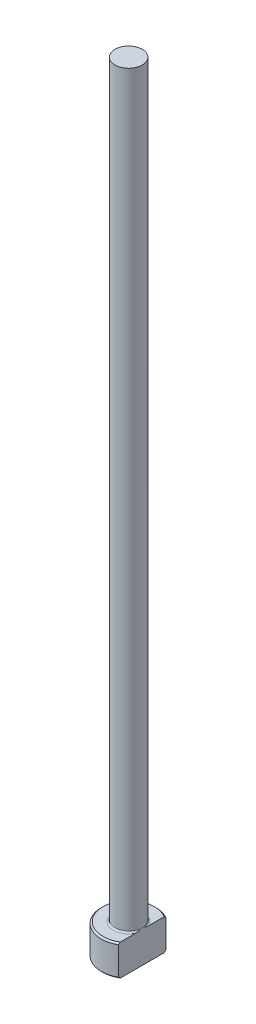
ISO-10303-21;
HEADER;
FILE_DESCRIPTION(('STEP AP214'),'2;1');
FILE_NAME('part.step','',(''),(''),'','','');
FILE_SCHEMA(('AUTOMOTIVE_DESIGN { 1 0 10303 214 1 1 1 1 }'));
ENDSEC;
DATA;
#1=APPLICATION_CONTEXT('core data for automotive mechanical design processes');
#2=APPLICATION_PROTOCOL_DEFINITION('international standard','automotive_design',2000,#1);
#3=PRODUCT_CONTEXT('',#1,'mechanical');
#4=PRODUCT('Part','Part','',(#3));
#5=PRODUCT_RELATED_PRODUCT_CATEGORY('part','',(#4));
#6=PRODUCT_DEFINITION_FORMATION('','',#4);
#7=PRODUCT_DEFINITION_CONTEXT('part definition',#1,'design');
#8=PRODUCT_DEFINITION('design','',#6,#7);
#9=PRODUCT_DEFINITION_SHAPE('','',#8);
#10=(LENGTH_UNIT() NAMED_UNIT(*) SI_UNIT(.MILLI.,.METRE.));
#11=(NAMED_UNIT(*) PLANE_ANGLE_UNIT() SI_UNIT($,.RADIAN.));
#12=(NAMED_UNIT(*) SI_UNIT($,.STERADIAN.) SOLID_ANGLE_UNIT());
#13=UNCERTAINTY_MEASURE_WITH_UNIT(LENGTH_MEASURE(1.E-05),#10,'distance_accuracy_value','');
#14=(GEOMETRIC_REPRESENTATION_CONTEXT(3) GLOBAL_UNCERTAINTY_ASSIGNED_CONTEXT((#13)) GLOBAL_UNIT_ASSIGNED_CONTEXT((#10,
#11,#12)) REPRESENTATION_CONTEXT('',''));
#15=CARTESIAN_POINT('',(0.,0.,0.));
#16=DIRECTION('',(0.,0.,1.));
#17=DIRECTION('',(1.,0.,0.));
#18=AXIS2_PLACEMENT_3D('',#15,#16,#17);
#19=CARTESIAN_POINT('',(0.,0.,0.));
#20=DIRECTION('',(0.,-1.,0.));
#21=DIRECTION('',(0.,0.,-1.));
#22=AXIS2_PLACEMENT_3D('',#19,#20,#21);
#23=PLANE('',#22);
#24=CARTESIAN_POINT('',(0.,0.,0.));
#25=DIRECTION('',(0.,-1.,0.));
#26=DIRECTION('',(0.,0.,-1.));
#27=AXIS2_PLACEMENT_3D('',#24,#25,#26);
#28=CIRCLE('',#27,3.29999999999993);
#29=CARTESIAN_POINT('',(1.74999999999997,0.,2.79776696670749));
#30=VERTEX_POINT('',#29);
#31=CARTESIAN_POINT('',(1.74999999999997,0.,-2.79776696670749));
#32=VERTEX_POINT('',#31);
#33=EDGE_CURVE('E98',#30,#32,#28,.T.);
#34=ORIENTED_EDGE('',*,*,#33,.T.);
#35=DIRECTION('',(0.,0.,1.));
#36=VECTOR('',#35,1.);
#37=CARTESIAN_POINT('',(1.74999999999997,0.,3.03108891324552));
#38=LINE('',#37,#36);
#39=EDGE_CURVE('E83',#32,#30,#38,.T.);
#40=ORIENTED_EDGE('',*,*,#39,.T.);
#41=EDGE_LOOP('',(#34,#40));
#42=FACE_BOUND('',#41,.T.);
#43=ADVANCED_FACE('F32',(#42),#23,.T.);
#44=CARTESIAN_POINT('',(0.,259.958771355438,0.));
#45=DIRECTION('',(0.,1.,0.));
#46=DIRECTION('',(0.,0.,1.));
#47=AXIS2_PLACEMENT_3D('',#44,#45,#46);
#48=CYLINDRICAL_SURFACE('',#47,3.49999999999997);
#49=CARTESIAN_POINT('',(0.,3.80000000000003,0.));
#50=DIRECTION('',(0.,1.,0.));
#51=DIRECTION('',(0.,0.,1.));
#52=AXIS2_PLACEMENT_3D('',#49,#50,#51);
#53=CIRCLE('',#52,3.49999999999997);
#54=CARTESIAN_POINT('',(1.74999999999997,3.80000000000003,3.03108891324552));
#55=VERTEX_POINT('',#54);
#56=CARTESIAN_POINT('',(1.74999999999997,3.80000000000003,-3.03108891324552));
#57=VERTEX_POINT('',#56);
#58=EDGE_CURVE('E104',#55,#57,#53,.F.);
#59=ORIENTED_EDGE('',*,*,#58,.T.);
#60=DIRECTION('',(0.,-1.,0.));
#61=VECTOR('',#60,1.);
#62=CARTESIAN_POINT('',(1.74999999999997,100.,-3.03108891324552));
#63=LINE('',#62,#61);
#64=CARTESIAN_POINT('',(1.74999999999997,0.200000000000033,-3.03108891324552));
#65=VERTEX_POINT('',#64);
#66=EDGE_CURVE('E183',#57,#65,#63,.T.);
#67=ORIENTED_EDGE('',*,*,#66,.T.);
#68=CARTESIAN_POINT('',(0.,0.200000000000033,0.));
#69=DIRECTION('',(0.,-1.,0.));
#70=DIRECTION('',(0.,0.,-1.));
#71=AXIS2_PLACEMENT_3D('',#68,#69,#70);
#72=CIRCLE('',#71,3.49999999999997);
#73=CARTESIAN_POINT('',(1.74999999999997,0.200000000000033,3.03108891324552));
#74=VERTEX_POINT('',#73);
#75=EDGE_CURVE('E100',#65,#74,#72,.F.);
#76=ORIENTED_EDGE('',*,*,#75,.T.);
#77=DIRECTION('',(0.,-1.,0.));
#78=VECTOR('',#77,1.);
#79=CARTESIAN_POINT('',(1.74999999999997,100.,3.03108891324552));
#80=LINE('',#79,#78);
#81=EDGE_CURVE('E93',#55,#74,#80,.T.);
#82=ORIENTED_EDGE('',*,*,#81,.F.);
#83=EDGE_LOOP('',(#59,#67,#76,#82));
#84=FACE_BOUND('',#83,.T.);
#85=ADVANCED_FACE('F158',(#84),#48,.T.);
#86=CARTESIAN_POINT('',(-3.49999999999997,4.,0.));
#87=DIRECTION('',(0.,1.,0.));
#88=DIRECTION('',(0.,0.,1.));
#89=AXIS2_PLACEMENT_3D('',#86,#87,#88);
#90=PLANE('',#89);
#91=CARTESIAN_POINT('',(0.,4.,0.));
#92=DIRECTION('',(0.,1.,0.));
#93=DIRECTION('',(0.,0.,1.));
#94=AXIS2_PLACEMENT_3D('',#91,#92,#93);
#95=CIRCLE('',#94,3.29999999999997);
#96=CARTESIAN_POINT('',(1.74999999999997,4.,-2.79776696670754));
#97=VERTEX_POINT('',#96);
#98=CARTESIAN_POINT('',(1.74999999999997,4.,2.79776696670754));
#99=VERTEX_POINT('',#98);
#100=EDGE_CURVE('E178',#97,#99,#95,.T.);
#101=ORIENTED_EDGE('',*,*,#100,.T.);
#102=DIRECTION('',(0.,0.,-1.));
#103=VECTOR('',#102,1.);
#104=CARTESIAN_POINT('',(1.74999999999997,4.,0.));
#105=LINE('',#104,#103);
#106=CARTESIAN_POINT('',(1.74999999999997,3.99999999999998,0.860232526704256));
#107=VERTEX_POINT('',#106);
#108=EDGE_CURVE('E57',#99,#107,#105,.T.);
#109=ORIENTED_EDGE('',*,*,#108,.T.);
#110=CARTESIAN_POINT('',(0.,4.,0.));
#111=DIRECTION('',(0.,1.,0.));
#112=DIRECTION('',(0.,0.,1.));
#113=AXIS2_PLACEMENT_3D('',#110,#111,#112);
#114=CIRCLE('',#113,1.94999999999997);
#115=CARTESIAN_POINT('',(1.74999999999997,3.99999999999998,-0.860232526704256));
#116=VERTEX_POINT('',#115);
#117=EDGE_CURVE('E107',#107,#116,#114,.F.);
#118=ORIENTED_EDGE('',*,*,#117,.T.);
#119=EDGE_CURVE('E136',#116,#97,#105,.T.);
#120=ORIENTED_EDGE('',*,*,#119,.T.);
#121=EDGE_LOOP('',(#101,#109,#118,#120));
#122=FACE_BOUND('',#121,.T.);
#123=ADVANCED_FACE('F147',(#122),#90,.T.);
#124=CARTESIAN_POINT('',(0.,4.,0.));
#125=DIRECTION('',(0.,-1.,0.));
#126=DIRECTION('',(0.,0.,-1.));
#127=AXIS2_PLACEMENT_3D('',#124,#125,#126);
#128=CONICAL_SURFACE('',#127,3.29999999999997,0.785398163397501);
#129=ORIENTED_EDGE('',*,*,#58,.F.);
#130=CARTESIAN_POINT('',(1.74999999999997,0.403691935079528,6.67057455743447));
#131=CARTESIAN_POINT('',(1.74999999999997,0.549902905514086,6.51940719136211));
#132=CARTESIAN_POINT('',(1.74999999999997,0.695956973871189,6.3680875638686));
#133=CARTESIAN_POINT('',(1.74999999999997,0.987658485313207,6.06505321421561));
#134=CARTESIAN_POINT('',(1.74999999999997,1.13330592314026,5.91333848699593));
#135=CARTESIAN_POINT('',(1.74999999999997,1.42417201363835,5.60934946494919));
#136=CARTESIAN_POINT('',(1.74999999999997,1.56939040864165,5.45707492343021));
#137=CARTESIAN_POINT('',(1.74999999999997,1.85918520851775,5.15191761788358));
#138=CARTESIAN_POINT('',(1.74999999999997,2.0037616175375,4.9990348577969));
#139=CARTESIAN_POINT('',(1.74999999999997,2.28922437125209,4.69552747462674));
#140=CARTESIAN_POINT('',(1.74999999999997,2.43012702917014,4.54491820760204));
#141=CARTESIAN_POINT('',(1.74999999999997,2.71087777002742,4.24272028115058));
#142=CARTESIAN_POINT('',(1.74999999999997,2.85072585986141,4.0911316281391));
#143=CARTESIAN_POINT('',(1.74999999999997,3.12895853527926,3.78667524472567));
#144=CARTESIAN_POINT('',(1.74999999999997,3.26734342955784,3.63380779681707));
#145=CARTESIAN_POINT('',(1.74999999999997,3.54209958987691,3.32627683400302));
#146=CARTESIAN_POINT('',(1.74999999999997,3.67847093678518,3.17161339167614));
#147=CARTESIAN_POINT('',(1.74999999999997,3.8961728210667,2.91990258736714));
#148=CARTESIAN_POINT('',(1.74999999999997,3.97843114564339,2.82365864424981));
#149=CARTESIAN_POINT('',(1.74999999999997,4.14148360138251,2.62991861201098));
#150=CARTESIAN_POINT('',(1.74999999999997,4.2222775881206,2.53242240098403));
#151=CARTESIAN_POINT('',(1.74999999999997,4.38274452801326,2.33479038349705));
#152=CARTESIAN_POINT('',(1.74999999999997,4.46239661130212,2.23463757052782));
#153=CARTESIAN_POINT('',(1.74999999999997,4.61891495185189,2.03220225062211));
#154=CARTESIAN_POINT('',(1.74999999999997,4.69578187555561,1.92992026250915));
#155=CARTESIAN_POINT('',(1.74999999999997,4.84669654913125,1.72090511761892));
#156=CARTESIAN_POINT('',(1.74999999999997,4.92068375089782,1.61412795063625));
#157=CARTESIAN_POINT('',(1.74999999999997,5.06269616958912,1.39638381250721));
#158=CARTESIAN_POINT('',(1.74999999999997,5.13071318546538,1.28541136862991));
#159=CARTESIAN_POINT('',(1.74999999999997,5.22516490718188,1.11561175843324));
#160=CARTESIAN_POINT('',(1.74999999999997,5.25522351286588,1.058816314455));
#161=CARTESIAN_POINT('',(1.74999999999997,5.31237042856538,0.943756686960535));
#162=CARTESIAN_POINT('',(1.74999999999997,5.33945819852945,0.885492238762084));
#163=CARTESIAN_POINT('',(1.74999999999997,5.41499290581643,0.708569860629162));
#164=CARTESIAN_POINT('',(1.74999999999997,5.45796078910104,0.58735672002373));
#165=CARTESIAN_POINT('',(1.74999999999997,5.50447230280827,0.405622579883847));
#166=CARTESIAN_POINT('',(1.74999999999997,5.51680920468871,0.347327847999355));
#167=CARTESIAN_POINT('',(1.74999999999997,5.53592536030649,0.229813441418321));
#168=CARTESIAN_POINT('',(1.74999999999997,5.54270510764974,0.170593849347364));
#169=CARTESIAN_POINT('',(1.74999999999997,5.55022681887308,0.0519516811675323));
#170=CARTESIAN_POINT('',(1.74999999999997,5.55098747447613,-0.00746969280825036));
#171=CARTESIAN_POINT('',(1.74999999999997,5.5464654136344,-0.12608281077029));
#172=CARTESIAN_POINT('',(1.74999999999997,5.54118219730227,-0.185274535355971));
#173=CARTESIAN_POINT('',(1.74999999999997,5.52501178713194,-0.302357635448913));
#174=CARTESIAN_POINT('',(1.74999999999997,5.51417270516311,-0.360255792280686));
#175=CARTESIAN_POINT('',(1.74999999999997,5.48756668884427,-0.474896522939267));
#176=CARTESIAN_POINT('',(1.74999999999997,5.47179916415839,-0.531638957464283));
#177=CARTESIAN_POINT('',(1.74999999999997,5.43599695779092,-0.64410319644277));
#178=CARTESIAN_POINT('',(1.74999999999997,5.41593824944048,-0.699817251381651));
#179=CARTESIAN_POINT('',(1.74999999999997,5.37235913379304,-0.809843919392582));
#180=CARTESIAN_POINT('',(1.74999999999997,5.348839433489,-0.864156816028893));
#181=CARTESIAN_POINT('',(1.74999999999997,5.27385837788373,-1.0256237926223));
#182=CARTESIAN_POINT('',(1.74999999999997,5.21814894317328,-1.13079943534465));
#183=CARTESIAN_POINT('',(1.74999999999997,5.09935726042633,-1.33694307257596));
#184=CARTESIAN_POINT('',(1.74999999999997,5.03626572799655,-1.43790554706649));
#185=CARTESIAN_POINT('',(1.74999999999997,4.90490246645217,-1.63694628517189));
#186=CARTESIAN_POINT('',(1.74999999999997,4.83661129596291,-1.73501160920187));
#187=CARTESIAN_POINT('',(1.74999999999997,4.69663576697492,-1.92859117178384));
#188=CARTESIAN_POINT('',(1.74999999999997,4.62495312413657,-2.02410666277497));
#189=CARTESIAN_POINT('',(1.74999999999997,4.47817312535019,-2.21448054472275));
#190=CARTESIAN_POINT('',(1.74999999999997,4.4030432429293,-2.30931373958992));
#191=CARTESIAN_POINT('',(1.74999999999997,4.25092223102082,-2.49748629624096));
#192=CARTESIAN_POINT('',(1.74999999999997,4.17393090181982,-2.59082549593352));
#193=CARTESIAN_POINT('',(1.74999999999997,4.01873588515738,-2.77610276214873));
#194=CARTESIAN_POINT('',(1.74999999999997,3.94053559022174,-2.86804367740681));
#195=CARTESIAN_POINT('',(1.74999999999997,3.78305359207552,-3.05099558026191));
#196=CARTESIAN_POINT('',(1.74999999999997,3.70377186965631,-3.14200655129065));
#197=CARTESIAN_POINT('',(1.74999999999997,3.4917775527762,-3.38307713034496));
#198=CARTESIAN_POINT('',(1.74999999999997,3.3583209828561,-3.53248201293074));
#199=CARTESIAN_POINT('',(1.74999999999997,3.08977689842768,-3.82982116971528));
#200=CARTESIAN_POINT('',(1.74999999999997,2.95468933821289,-3.97775540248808));
#201=CARTESIAN_POINT('',(1.74999999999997,2.68319766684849,-4.27266697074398));
#202=CARTESIAN_POINT('',(1.74999999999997,2.5467924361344,-4.41964327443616));
#203=CARTESIAN_POINT('',(1.74999999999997,2.27308598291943,-4.71275937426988));
#204=CARTESIAN_POINT('',(1.74999999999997,2.13578475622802,-4.85889916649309));
#205=CARTESIAN_POINT('',(1.74999999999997,1.73418398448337,-5.28435414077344));
#206=CARTESIAN_POINT('',(1.74999999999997,1.46897142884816,-5.56280727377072));
#207=CARTESIAN_POINT('',(1.74999999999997,1.07010496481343,-5.97918348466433));
#208=CARTESIAN_POINT('',(1.74999999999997,0.937049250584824,-6.11768155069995));
#209=CARTESIAN_POINT('',(1.74999999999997,0.670604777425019,-6.39435480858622));
#210=CARTESIAN_POINT('',(1.74999999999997,0.537216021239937,-6.53253000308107));
#211=CARTESIAN_POINT('',(1.74999999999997,0.403691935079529,-6.67057455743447));
#212=B_SPLINE_CURVE_WITH_KNOTS('',3,(#130,#131,#132,#133,#134,#135,#136,#137,#138,#139,#140,
#141,#142,#143,#144,#145,#146,#147,#148,#149,#150,#151,#152,#153,#154,#155,#156,#157,#158,#159,
#160,#161,#162,#163,#164,#165,#166,#167,#168,#169,#170,#171,#172,#173,#174,#175,#176,#177,#178,
#179,#180,#181,#182,#183,#184,#185,#186,#187,#188,#189,#190,#191,#192,#193,#194,#195,#196,#197,
#198,#199,#200,#201,#202,#203,#204,#205,#206,#207,#208,#209,#210,#211),.UNSPECIFIED.,.F.,.F.,(4,
2,2,2,2,2,2,2,2,2,2,2,2,2,2,2,2,2,2,2,2,2,2,2,2,2,2,2,2,2,2,2,2,2,2,2,2,2,2,2,4),(0.,
0.630922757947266,1.26185363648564,1.89310749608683,2.52435727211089,3.14308654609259,
3.76181177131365,4.38040374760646,4.9989708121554,5.37878108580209,5.7586286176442,
6.14249031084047,6.52625953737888,6.91585739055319,7.30598230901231,7.49867618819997,
7.69140503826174,8.07538783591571,8.25392686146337,8.43245002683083,8.61041858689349,
8.78840186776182,8.96486927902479,9.14135783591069,9.31886171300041,9.49632938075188,
9.85286274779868,10.2098494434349,10.5682434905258,10.9264581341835,11.2893876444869,
11.6523562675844,12.0144447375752,12.3765396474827,12.9775131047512,13.5785034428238,
14.1800594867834,14.7816183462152,15.9352370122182,16.51140505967,17.0875683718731),.UNSPECIFIED.);
#213=EDGE_CURVE('E135',#55,#99,#212,.T.);
#214=ORIENTED_EDGE('',*,*,#213,.T.);
#215=ORIENTED_EDGE('',*,*,#100,.F.);
#216=EDGE_CURVE('E127',#97,#57,#212,.T.);
#217=ORIENTED_EDGE('',*,*,#216,.T.);
#218=EDGE_LOOP('',(#129,#214,#215,#217));
#219=FACE_BOUND('',#218,.T.);
#220=ADVANCED_FACE('F143',(#219),#128,.T.);
#221=CARTESIAN_POINT('',(0.,0.200000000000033,0.));
#222=DIRECTION('',(0.,1.,0.));
#223=DIRECTION('',(0.,0.,1.));
#224=AXIS2_PLACEMENT_3D('',#221,#222,#223);
#225=CONICAL_SURFACE('',#224,3.49999999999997,0.785398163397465);
#226=ORIENTED_EDGE('',*,*,#75,.F.);
#227=CARTESIAN_POINT('',(1.74999999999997,3.59630806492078,-6.67057455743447));
#228=CARTESIAN_POINT('',(1.74999999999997,3.4500970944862,-6.51940719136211));
#229=CARTESIAN_POINT('',(1.74999999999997,3.30404302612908,-6.36808756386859));
#230=CARTESIAN_POINT('',(1.74999999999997,3.01234151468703,-6.06505321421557));
#231=CARTESIAN_POINT('',(1.74999999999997,2.86669407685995,-5.91333848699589));
#232=CARTESIAN_POINT('',(1.74999999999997,2.57582798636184,-5.60934946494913));
#233=CARTESIAN_POINT('',(1.74999999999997,2.43060959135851,-5.45707492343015));
#234=CARTESIAN_POINT('',(1.74999999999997,2.14081479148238,-5.15191761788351));
#235=CARTESIAN_POINT('',(1.74999999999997,1.99623838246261,-4.99903485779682));
#236=CARTESIAN_POINT('',(1.74999999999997,1.71077562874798,-4.69552747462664));
#237=CARTESIAN_POINT('',(1.74999999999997,1.56987297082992,-4.54491820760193));
#238=CARTESIAN_POINT('',(1.74999999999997,1.28912222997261,-4.24272028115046));
#239=CARTESIAN_POINT('',(1.74999999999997,1.1492741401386,-4.09113162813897));
#240=CARTESIAN_POINT('',(1.74999999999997,0.87104146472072,-3.78667524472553));
#241=CARTESIAN_POINT('',(1.74999999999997,0.73265657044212,-3.63380779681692));
#242=CARTESIAN_POINT('',(1.74999999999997,0.457900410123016,-3.32627683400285));
#243=CARTESIAN_POINT('',(1.74999999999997,0.321529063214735,-3.17161339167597));
#244=CARTESIAN_POINT('',(1.74999999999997,0.103827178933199,-2.91990258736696));
#245=CARTESIAN_POINT('',(1.74999999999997,0.0215688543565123,-2.82365864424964));
#246=CARTESIAN_POINT('',(1.74999999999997,-0.14148360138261,-2.62991861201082));
#247=CARTESIAN_POINT('',(1.74999999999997,-0.222277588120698,-2.53242240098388));
#248=CARTESIAN_POINT('',(1.74999999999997,-0.382744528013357,-2.3347903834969));
#249=CARTESIAN_POINT('',(1.74999999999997,-0.462396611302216,-2.23463757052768));
#250=CARTESIAN_POINT('',(1.74999999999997,-0.618914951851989,-2.03220225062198));
#251=CARTESIAN_POINT('',(1.74999999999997,-0.695781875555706,-1.92992026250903));
#252=CARTESIAN_POINT('',(1.74999999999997,-0.84669654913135,-1.7209051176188));
#253=CARTESIAN_POINT('',(1.74999999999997,-0.920683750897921,-1.61412795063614));
#254=CARTESIAN_POINT('',(1.74999999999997,-1.06269616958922,-1.3963838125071));
#255=CARTESIAN_POINT('',(1.74999999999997,-1.13071318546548,-1.28541136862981));
#256=CARTESIAN_POINT('',(1.74999999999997,-1.22516490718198,-1.11561175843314));
#257=CARTESIAN_POINT('',(1.74999999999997,-1.25522351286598,-1.05881631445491));
#258=CARTESIAN_POINT('',(1.74999999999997,-1.31237042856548,-0.943756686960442));
#259=CARTESIAN_POINT('',(1.74999999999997,-1.33945819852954,-0.885492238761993));
#260=CARTESIAN_POINT('',(1.74999999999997,-1.41499290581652,-0.708569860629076));
#261=CARTESIAN_POINT('',(1.74999999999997,-1.45796078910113,-0.587356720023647));
#262=CARTESIAN_POINT('',(1.74999999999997,-1.50447230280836,-0.405622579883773));
#263=CARTESIAN_POINT('',(1.74999999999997,-1.51680920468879,-0.347327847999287));
#264=CARTESIAN_POINT('',(1.74999999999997,-1.53592536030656,-0.229813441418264));
#265=CARTESIAN_POINT('',(1.74999999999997,-1.54270510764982,-0.170593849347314));
#266=CARTESIAN_POINT('',(1.74999999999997,-1.55022681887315,-0.0519516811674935));
#267=CARTESIAN_POINT('',(1.74999999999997,-1.5509874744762,0.00746969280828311));
#268=CARTESIAN_POINT('',(1.74999999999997,-1.54646541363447,0.126082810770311));
#269=CARTESIAN_POINT('',(1.74999999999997,-1.54118219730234,0.185274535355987));
#270=CARTESIAN_POINT('',(1.74999999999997,-1.52501178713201,0.302357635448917));
#271=CARTESIAN_POINT('',(1.74999999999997,-1.51417270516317,0.360255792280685));
#272=CARTESIAN_POINT('',(1.74999999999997,-1.48756668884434,0.474896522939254));
#273=CARTESIAN_POINT('',(1.74999999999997,-1.47179916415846,0.531638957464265));
#274=CARTESIAN_POINT('',(1.74999999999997,-1.43599695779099,0.64410319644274));
#275=CARTESIAN_POINT('',(1.74999999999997,-1.41593824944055,0.699817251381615));
#276=CARTESIAN_POINT('',(1.74999999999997,-1.37235913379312,0.809843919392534));
#277=CARTESIAN_POINT('',(1.74999999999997,-1.34883943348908,0.86415681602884));
#278=CARTESIAN_POINT('',(1.74999999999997,-1.27385837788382,1.02562379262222));
#279=CARTESIAN_POINT('',(1.74999999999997,-1.21814894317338,1.13079943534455));
#280=CARTESIAN_POINT('',(1.74999999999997,-1.09935726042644,1.33694307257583));
#281=CARTESIAN_POINT('',(1.74999999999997,-1.03626572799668,1.43790554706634));
#282=CARTESIAN_POINT('',(1.74999999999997,-0.904902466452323,1.6369462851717));
#283=CARTESIAN_POINT('',(1.74999999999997,-0.836611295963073,1.73501160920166));
#284=CARTESIAN_POINT('',(1.74999999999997,-0.696635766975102,1.9285911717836));
#285=CARTESIAN_POINT('',(1.74999999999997,-0.624953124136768,2.02410666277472));
#286=CARTESIAN_POINT('',(1.74999999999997,-0.478173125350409,2.21448054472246));
#287=CARTESIAN_POINT('',(1.74999999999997,-0.40304324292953,2.30931373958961));
#288=CARTESIAN_POINT('',(1.74999999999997,-0.250922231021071,2.49748629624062));
#289=CARTESIAN_POINT('',(1.74999999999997,-0.173930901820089,2.59082549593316));
#290=CARTESIAN_POINT('',(1.74999999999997,-0.0187358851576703,2.77610276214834));
#291=CARTESIAN_POINT('',(1.74999999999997,0.0594644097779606,2.8680436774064));
#292=CARTESIAN_POINT('',(1.74999999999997,0.216946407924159,3.05099558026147));
#293=CARTESIAN_POINT('',(1.74999999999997,0.296228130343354,3.14200655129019));
#294=CARTESIAN_POINT('',(1.74999999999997,0.508222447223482,3.3830771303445));
#295=CARTESIAN_POINT('',(1.74999999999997,0.641679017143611,3.53248201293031));
#296=CARTESIAN_POINT('',(1.74999999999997,0.910223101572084,3.8298211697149));
#297=CARTESIAN_POINT('',(1.74999999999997,1.0453106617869,3.97775540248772));
#298=CARTESIAN_POINT('',(1.74999999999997,1.31680233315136,4.27266697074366));
#299=CARTESIAN_POINT('',(1.74999999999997,1.45320756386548,4.41964327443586));
#300=CARTESIAN_POINT('',(1.74999999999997,1.7269140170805,4.71275937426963));
#301=CARTESIAN_POINT('',(1.74999999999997,1.86421524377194,4.85889916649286));
#302=CARTESIAN_POINT('',(1.74999999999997,2.26581601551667,5.28435414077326));
#303=CARTESIAN_POINT('',(1.74999999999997,2.53102857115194,5.56280727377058));
#304=CARTESIAN_POINT('',(1.74999999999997,2.92989503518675,5.97918348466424));
#305=CARTESIAN_POINT('',(1.74999999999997,3.06295074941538,6.11768155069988));
#306=CARTESIAN_POINT('',(1.74999999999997,3.32939522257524,6.39435480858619));
#307=CARTESIAN_POINT('',(1.74999999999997,3.46278397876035,6.53253000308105));
#308=CARTESIAN_POINT('',(1.74999999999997,3.59630806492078,6.67057455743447));
#309=B_SPLINE_CURVE_WITH_KNOTS('',3,(#227,#228,#229,#230,#231,#232,#233,#234,#235,#236,#237,
#238,#239,#240,#241,#242,#243,#244,#245,#246,#247,#248,#249,#250,#251,#252,#253,#254,#255,#256,
#257,#258,#259,#260,#261,#262,#263,#264,#265,#266,#267,#268,#269,#270,#271,#272,#273,#274,#275,
#276,#277,#278,#279,#280,#281,#282,#283,#284,#285,#286,#287,#288,#289,#290,#291,#292,#293,#294,
#295,#296,#297,#298,#299,#300,#301,#302,#303,#304,#305,#306,#307,#308),.UNSPECIFIED.,.F.,.F.,(4,
2,2,2,2,2,2,2,2,2,2,2,2,2,2,2,2,2,2,2,2,2,2,2,2,2,2,2,2,2,2,2,2,2,2,2,2,2,2,2,4),(0.,
0.630922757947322,1.26185363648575,1.893107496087,2.5243572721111,3.14308654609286,
3.76181177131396,4.38040374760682,4.99897081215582,5.37878108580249,5.75862861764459,
6.14249031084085,6.52625953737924,6.91585739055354,7.30598230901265,7.49867618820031,
7.69140503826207,8.07538783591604,8.25392686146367,8.43245002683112,8.61041858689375,
8.78840186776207,8.96486927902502,9.14135783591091,9.31886171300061,9.49632938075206,
9.8528627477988,10.209849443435,10.5682434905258,10.9264581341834,11.2893876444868,
11.6523562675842,12.014444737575,12.3765396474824,12.977513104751,13.5785034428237,
14.1800594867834,14.7816183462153,15.9352370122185,16.5114050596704,17.0875683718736),.UNSPECIFIED.);
#310=EDGE_CURVE('E86',#65,#32,#309,.T.);
#311=ORIENTED_EDGE('',*,*,#310,.T.);
#312=ORIENTED_EDGE('',*,*,#33,.F.);
#313=EDGE_CURVE('E89',#30,#74,#309,.T.);
#314=ORIENTED_EDGE('',*,*,#313,.T.);
#315=EDGE_LOOP('',(#226,#311,#312,#314));
#316=FACE_BOUND('',#315,.T.);
#317=ADVANCED_FACE('F97',(#316),#225,.T.);
#318=CARTESIAN_POINT('',(0.,4.19999999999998,0.));
#319=DIRECTION('',(0.,1.,0.));
#320=DIRECTION('',(0.,0.,1.));
#321=AXIS2_PLACEMENT_3D('',#318,#319,#320);
#322=TOROIDAL_SURFACE('',#321,1.94999999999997,0.2);
#323=CARTESIAN_POINT('',(1.74999999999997,4.19999999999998,0.));
#324=CARTESIAN_POINT('',(1.74999999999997,4.2000005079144,9.3867964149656E-11));
#325=CARTESIAN_POINT('',(1.74999999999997,4.20000101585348,-1.34501103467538E-07));
#326=CARTESIAN_POINT('',(1.74999999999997,4.20000198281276,-5.41283480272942E-07));
#327=CARTESIAN_POINT('',(1.74999999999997,4.20000243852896,-8.19487716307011E-07));
#328=CARTESIAN_POINT('',(1.74999999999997,4.2000033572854,-1.4843911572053E-06));
#329=CARTESIAN_POINT('',(1.74999999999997,4.20000381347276,-1.8805263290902E-06));
#330=CARTESIAN_POINT('',(1.74999999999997,4.2000046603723,-2.72280867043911E-06));
#331=CARTESIAN_POINT('',(1.74999999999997,4.20000505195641,-3.16812554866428E-06));
#332=CARTESIAN_POINT('',(1.74999999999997,4.20000641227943,-4.80772283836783E-06));
#333=CARTESIAN_POINT('',(1.74999999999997,4.20000730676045,-6.06508173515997E-06));
#334=CARTESIAN_POINT('',(1.74999999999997,4.20000885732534,-8.62364313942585E-06));
#335=CARTESIAN_POINT('',(1.74999999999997,4.2000095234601,-9.91907771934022E-06));
#336=CARTESIAN_POINT('',(1.74999999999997,4.20001212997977,-1.51310766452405E-05));
#337=CARTESIAN_POINT('',(1.74999999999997,4.20001395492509,-1.91092656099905E-05));
#338=CARTESIAN_POINT('',(1.74999999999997,4.200016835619,-2.68327807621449E-05));
#339=CARTESIAN_POINT('',(1.74999999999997,4.20001795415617,-3.05551301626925E-05));
#340=CARTESIAN_POINT('',(1.74999999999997,4.20002287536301,-4.68261375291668E-05));
#341=CARTESIAN_POINT('',(1.74999999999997,4.20002674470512,-5.93446279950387E-05));
#342=CARTESIAN_POINT('',(1.74999999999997,4.20003278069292,-8.25255943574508E-05));
#343=CARTESIAN_POINT('',(1.74999999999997,4.2000351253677,-9.31393224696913E-05));
#344=CARTESIAN_POINT('',(1.74999999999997,4.20005413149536,-0.000171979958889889));
#345=CARTESIAN_POINT('',(1.74999999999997,4.20007897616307,-0.000237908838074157));
#346=CARTESIAN_POINT('',(1.74999999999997,4.20017305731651,-0.000496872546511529));
#347=CARTESIAN_POINT('',(1.74999999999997,4.20023617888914,-0.000691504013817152));
#348=CARTESIAN_POINT('',(1.74999999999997,4.20048774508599,-0.00145613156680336));
#349=CARTESIAN_POINT('',(1.74999999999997,4.20068259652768,-0.00202450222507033));
#350=CARTESIAN_POINT('',(1.74999999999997,4.20148279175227,-0.00436941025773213));
#351=CARTESIAN_POINT('',(1.74999999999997,4.20208089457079,-0.00614773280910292));
#352=CARTESIAN_POINT('',(1.74999999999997,4.20853845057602,-0.0253339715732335));
#353=CARTESIAN_POINT('',(1.74999999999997,4.21443574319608,-0.0427328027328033));
#354=CARTESIAN_POINT('',(1.74999999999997,4.22594434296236,-0.076884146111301));
#355=CARTESIAN_POINT('',(1.74999999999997,4.23155796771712,-0.0936359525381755));
#356=CARTESIAN_POINT('',(1.74999999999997,4.24339960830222,-0.129193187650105));
#357=CARTESIAN_POINT('',(1.74999999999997,4.24961959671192,-0.148001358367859));
#358=CARTESIAN_POINT('',(1.74999999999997,4.26199268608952,-0.185858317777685));
#359=CARTESIAN_POINT('',(1.74999999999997,4.26814439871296,-0.204907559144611));
#360=CARTESIAN_POINT('',(1.74999999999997,4.28302129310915,-0.251728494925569));
#361=CARTESIAN_POINT('',(1.74999999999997,4.2916463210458,-0.279532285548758));
#362=CARTESIAN_POINT('',(1.74999999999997,4.30815507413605,-0.334622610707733));
#363=CARTESIAN_POINT('',(1.74999999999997,4.3160517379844,-0.36190524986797));
#364=CARTESIAN_POINT('',(1.74999999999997,4.33270110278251,-0.422187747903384));
#365=CARTESIAN_POINT('',(1.74999999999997,4.34130455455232,-0.455229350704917));
#366=CARTESIAN_POINT('',(1.74999999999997,4.35728256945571,-0.521873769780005));
#367=CARTESIAN_POINT('',(1.74999999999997,4.36464748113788,-0.555478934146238));
#368=CARTESIAN_POINT('',(1.74999999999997,4.37810121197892,-0.625225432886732));
#369=CARTESIAN_POINT('',(1.74999999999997,4.38407559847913,-0.661389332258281));
#370=CARTESIAN_POINT('',(1.74999999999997,4.39348021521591,-0.733973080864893));
#371=CARTESIAN_POINT('',(1.74999999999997,4.39691695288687,-0.77039203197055));
#372=CARTESIAN_POINT('',(1.74999999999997,4.39990626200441,-0.832262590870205));
#373=CARTESIAN_POINT('',(1.74999999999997,4.40032395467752,-0.857670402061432));
#374=CARTESIAN_POINT('',(1.74999999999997,4.39916217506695,-0.908260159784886));
#375=CARTESIAN_POINT('',(1.74999999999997,4.39759783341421,-0.933442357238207));
#376=CARTESIAN_POINT('',(1.74999999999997,4.39129859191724,-0.989903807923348));
#377=CARTESIAN_POINT('',(1.74999999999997,4.38586007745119,-1.02110925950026));
#378=CARTESIAN_POINT('',(1.74999999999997,4.36964168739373,-1.08216800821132));
#379=CARTESIAN_POINT('',(1.74999999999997,4.35888918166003,-1.11202738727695));
#380=CARTESIAN_POINT('',(1.74999999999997,4.33961802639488,-1.14878048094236));
#381=CARTESIAN_POINT('',(1.74999999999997,4.33455492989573,-1.15748014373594));
#382=CARTESIAN_POINT('',(1.74999999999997,4.32351587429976,-1.17429661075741));
#383=CARTESIAN_POINT('',(1.74999999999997,4.31753946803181,-1.18241312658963));
#384=CARTESIAN_POINT('',(1.74999999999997,4.30451428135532,-1.19787793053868));
#385=CARTESIAN_POINT('',(1.74999999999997,4.29745609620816,-1.20521842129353));
#386=CARTESIAN_POINT('',(1.74999999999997,4.28223524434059,-1.21865698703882));
#387=CARTESIAN_POINT('',(1.74999999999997,4.27407476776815,-1.22475746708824));
#388=CARTESIAN_POINT('',(1.74999999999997,4.25920166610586,-1.23370537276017));
#389=CARTESIAN_POINT('',(1.74999999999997,4.25274944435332,-1.23698363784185));
#390=CARTESIAN_POINT('',(1.74999999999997,4.23939659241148,-1.24245066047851));
#391=CARTESIAN_POINT('',(1.74999999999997,4.23249637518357,-1.2446404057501));
#392=CARTESIAN_POINT('',(1.74999999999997,4.21836445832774,-1.24776583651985));
#393=CARTESIAN_POINT('',(1.74999999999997,4.21113087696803,-1.24869317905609));
#394=CARTESIAN_POINT('',(1.74999999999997,4.19661788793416,-1.24917680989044));
#395=CARTESIAN_POINT('',(1.74999999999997,4.18933848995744,-1.2487333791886));
#396=CARTESIAN_POINT('',(1.74999999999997,4.17564813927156,-1.2466228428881));
#397=CARTESIAN_POINT('',(1.74999999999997,4.16921873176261,-1.24507159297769));
#398=CARTESIAN_POINT('',(1.74999999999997,4.1566813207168,-1.24099086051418));
#399=CARTESIAN_POINT('',(1.74999999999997,4.15057343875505,-1.23846101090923));
#400=CARTESIAN_POINT('',(1.74999999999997,4.13656990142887,-1.23147130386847));
#401=CARTESIAN_POINT('',(1.74999999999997,4.12885825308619,-1.22664351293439));
#402=CARTESIAN_POINT('',(1.74999999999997,4.11430996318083,-1.21581214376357));
#403=CARTESIAN_POINT('',(1.74999999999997,4.10747539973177,-1.20980585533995));
#404=CARTESIAN_POINT('',(1.74999999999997,4.09141283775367,-1.19367262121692));
#405=CARTESIAN_POINT('',(1.74999999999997,4.08273353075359,-1.18300273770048));
#406=CARTESIAN_POINT('',(1.74999999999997,4.06710756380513,-1.16049397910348));
#407=CARTESIAN_POINT('',(1.74999999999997,4.06016260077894,-1.14865397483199));
#408=CARTESIAN_POINT('',(1.74999999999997,4.04314403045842,-1.11526045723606));
#409=CARTESIAN_POINT('',(1.74999999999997,4.03452872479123,-1.09297031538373));
#410=CARTESIAN_POINT('',(1.74999999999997,4.02051872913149,-1.04724849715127));
#411=CARTESIAN_POINT('',(1.74999999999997,4.015155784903,-1.02380790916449));
#412=CARTESIAN_POINT('',(1.74999999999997,4.00698483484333,-0.976403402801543));
#413=CARTESIAN_POINT('',(1.74999999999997,4.00418732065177,-0.952437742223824));
#414=CARTESIAN_POINT('',(1.74999999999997,4.00064912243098,-0.904321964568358));
#415=CARTESIAN_POINT('',(1.74999999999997,3.99991269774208,-0.88017156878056));
#416=CARTESIAN_POINT('',(1.74999999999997,4.00019275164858,-0.809643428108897));
#417=CARTESIAN_POINT('',(1.74999999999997,4.00344813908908,-0.763278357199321));
#418=CARTESIAN_POINT('',(1.74999999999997,4.01492484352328,-0.664825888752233));
#419=CARTESIAN_POINT('',(1.74999999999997,4.02376250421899,-0.612819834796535));
#420=CARTESIAN_POINT('',(1.74999999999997,4.04538488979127,-0.508370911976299));
#421=CARTESIAN_POINT('',(1.74999999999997,4.0582587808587,-0.455947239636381));
#422=CARTESIAN_POINT('',(1.74999999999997,4.08196429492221,-0.368604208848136));
#423=CARTESIAN_POINT('',(1.74999999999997,4.09211504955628,-0.333493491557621));
#424=CARTESIAN_POINT('',(1.74999999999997,4.11312724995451,-0.263893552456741));
#425=CARTESIAN_POINT('',(1.74999999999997,4.12397997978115,-0.229401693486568));
#426=CARTESIAN_POINT('',(1.74999999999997,4.14496676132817,-0.164340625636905));
#427=CARTESIAN_POINT('',(1.74999999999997,4.15504975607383,-0.133754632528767));
#428=CARTESIAN_POINT('',(1.74999999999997,4.17587821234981,-0.0714242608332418));
#429=CARTESIAN_POINT('',(1.74999999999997,4.18663395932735,-0.0396831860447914));
#430=CARTESIAN_POINT('',(1.74999999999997,4.19791979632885,-0.00614534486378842));
#431=CARTESIAN_POINT('',(1.74999999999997,4.19851877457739,-0.00436467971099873));
#432=CARTESIAN_POINT('',(1.74999999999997,4.19931918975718,-0.00201922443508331));
#433=CARTESIAN_POINT('',(1.74999999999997,4.19951342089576,-0.00145265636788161));
#434=CARTESIAN_POINT('',(1.74999999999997,4.19976423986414,-0.000690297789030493));
#435=CARTESIAN_POINT('',(1.74999999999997,4.19982721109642,-0.000496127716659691));
#436=CARTESIAN_POINT('',(1.74999999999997,4.19992109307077,-0.000237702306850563));
#437=CARTESIAN_POINT('',(1.74999999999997,4.19994590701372,-0.000171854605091));
#438=CARTESIAN_POINT('',(1.74999999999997,4.19996489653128,-9.3104554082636E-05));
#439=CARTESIAN_POINT('',(1.74999999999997,4.1999672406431,-8.24963339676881E-05));
#440=CARTESIAN_POINT('',(1.74999999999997,4.19997327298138,-5.9327776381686E-05));
#441=CARTESIAN_POINT('',(1.74999999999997,4.19997713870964,-4.68160430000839E-05));
#442=CARTESIAN_POINT('',(1.74999999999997,4.19998205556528,-3.0552584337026E-05));
#443=CARTESIAN_POINT('',(1.74999999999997,4.19998317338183,-2.68310311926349E-05));
#444=CARTESIAN_POINT('',(1.74999999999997,4.19998605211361,-1.91090651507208E-05));
#445=CARTESIAN_POINT('',(1.74999999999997,4.1999878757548,-1.51315954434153E-05));
#446=CARTESIAN_POINT('',(1.74999999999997,4.19999048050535,-9.92029976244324E-06));
#447=CARTESIAN_POINT('',(1.74999999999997,4.19999114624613,-8.62492595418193E-06));
#448=CARTESIAN_POINT('',(1.74999999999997,4.19999269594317,-6.06641158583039E-06));
#449=CARTESIAN_POINT('',(1.74999999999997,4.19999358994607,-4.80903338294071E-06));
#450=CARTESIAN_POINT('',(1.74999999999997,4.19999494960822,-3.1693219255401E-06));
#451=CARTESIAN_POINT('',(1.74999999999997,4.19999534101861,-2.7239538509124E-06));
#452=CARTESIAN_POINT('',(1.74999999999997,4.19999618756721,-1.88153783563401E-06));
#453=CARTESIAN_POINT('',(1.74999999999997,4.19999664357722,-1.48531960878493E-06));
#454=CARTESIAN_POINT('',(1.74999999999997,4.19999756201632,-8.20216876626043E-07));
#455=CARTESIAN_POINT('',(1.74999999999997,4.19999801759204,-5.41901820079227E-07));
#456=CARTESIAN_POINT('',(1.74999999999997,4.19999898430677,-1.34847130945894E-07));
#457=CARTESIAN_POINT('',(1.74999999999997,4.19999949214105,-9.38577104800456E-11));
#458=CARTESIAN_POINT('',(1.74999999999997,4.19999999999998,0.));
#459=B_SPLINE_CURVE_WITH_KNOTS('',3,(#323,#324,#325,#326,#327,#328,#329,#330,#331,#332,#333,
#334,#335,#336,#337,#338,#339,#340,#341,#342,#343,#344,#345,#346,#347,#348,#349,#350,#351,#352,
#353,#354,#355,#356,#357,#358,#359,#360,#361,#362,#363,#364,#365,#366,#367,#368,#369,#370,#371,
#372,#373,#374,#375,#376,#377,#378,#379,#380,#381,#382,#383,#384,#385,#386,#387,#388,#389,#390,
#391,#392,#393,#394,#395,#396,#397,#398,#399,#400,#401,#402,#403,#404,#405,#406,#407,#408,#409,
#410,#411,#412,#413,#414,#415,#416,#417,#418,#419,#420,#421,#422,#423,#424,#425,#426,#427,#428,
#429,#430,#431,#432,#433,#434,#435,#436,#437,#438,#439,#440,#441,#442,#443,#444,#445,#446,#447,
#448,#449,#450,#451,#452,#453,#454,#455,#456,#457,#458),.UNSPECIFIED.,.T.,.F.,(4,2,2,2,2,2,2,2,
2,2,2,2,2,2,2,2,2,2,2,2,2,2,2,2,2,2,2,2,2,2,2,2,2,2,2,2,2,2,2,2,2,2,2,2,2,2,2,2,2,2,2,2,2,2,2,2,
2,2,2,2,2,2,2,2,2,2,2,4),(0.,1.52538200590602E-06,3.12059520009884E-06,4.92466441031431E-06,
6.70193570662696E-06,1.13103006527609E-05,1.56767122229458E-05,2.87740649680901E-05,
4.04214595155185E-05,7.97265132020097E-05,0.000112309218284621,0.000323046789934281,
0.000937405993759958,0.00273926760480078,0.00836862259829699,0.0634773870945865,
0.116480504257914,0.17590977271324,0.235963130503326,0.323291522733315,0.40849293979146,
0.510903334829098,0.614078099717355,0.723976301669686,0.833591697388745,0.909765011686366,
0.985360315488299,1.08013194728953,1.17442046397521,1.20457287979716,1.2347401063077,
1.26518627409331,1.29557281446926,1.3172031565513,1.33881383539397,1.36056665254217,
1.38231501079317,1.40207044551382,1.42183329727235,1.44897527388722,1.47618041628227,
1.51721056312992,1.55828069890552,1.62957223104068,1.70154887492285,1.77381858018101,
1.84623752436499,1.98535010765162,2.14342254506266,2.3052675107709,2.41490365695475,
2.52337268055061,2.6199888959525,2.72052170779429,2.72615854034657,2.72795468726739,
2.7285675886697,2.72877806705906,2.72881063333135,2.72884991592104,2.72886156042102,
2.7288746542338,2.72887901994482,2.72888362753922,2.72888540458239,2.72888720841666,
2.72888880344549,2.72889032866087),.UNSPECIFIED.);
#460=CARTESIAN_POINT('',(1.74999999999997,4.19999999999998,0.));
#461=VERTEX_POINT('',#460);
#462=EDGE_CURVE('E11',#116,#461,#459,.T.);
#463=ORIENTED_EDGE('',*,*,#462,.F.);
#464=ORIENTED_EDGE('',*,*,#117,.F.);
#465=CARTESIAN_POINT('',(1.74999999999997,4.19999999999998,0.));
#466=CARTESIAN_POINT('',(1.74999999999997,4.19999949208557,-9.386782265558E-11));
#467=CARTESIAN_POINT('',(1.74999999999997,4.19999898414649,1.34501103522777E-07));
#468=CARTESIAN_POINT('',(1.74999999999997,4.1999980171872,5.41283480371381E-07));
#469=CARTESIAN_POINT('',(1.74999999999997,4.199997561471,8.19487716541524E-07));
#470=CARTESIAN_POINT('',(1.74999999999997,4.19999664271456,1.48439115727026E-06));
#471=CARTESIAN_POINT('',(1.74999999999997,4.1999961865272,1.88052632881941E-06));
#472=CARTESIAN_POINT('',(1.74999999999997,4.19999533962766,2.72280867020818E-06));
#473=CARTESIAN_POINT('',(1.74999999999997,4.19999494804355,3.16812554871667E-06));
#474=CARTESIAN_POINT('',(1.74999999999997,4.19999358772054,4.80772283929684E-06));
#475=CARTESIAN_POINT('',(1.74999999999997,4.19999269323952,6.06508173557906E-06));
#476=CARTESIAN_POINT('',(1.74999999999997,4.19999114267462,8.62364313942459E-06));
#477=CARTESIAN_POINT('',(1.74999999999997,4.19999047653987,9.91907771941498E-06));
#478=CARTESIAN_POINT('',(1.74999999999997,4.19998787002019,1.51310766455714E-05));
#479=CARTESIAN_POINT('',(1.74999999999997,4.19998604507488,1.91092656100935E-05));
#480=CARTESIAN_POINT('',(1.74999999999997,4.19998316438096,2.68327807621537E-05));
#481=CARTESIAN_POINT('',(1.74999999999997,4.19998204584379,3.05551301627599E-05));
#482=CARTESIAN_POINT('',(1.74999999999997,4.19997712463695,4.68261375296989E-05));
#483=CARTESIAN_POINT('',(1.74999999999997,4.19997325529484,5.93446279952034E-05));
#484=CARTESIAN_POINT('',(1.74999999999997,4.19996721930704,8.25255943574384E-05));
#485=CARTESIAN_POINT('',(1.74999999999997,4.19996487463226,9.31393224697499E-05));
#486=CARTESIAN_POINT('',(1.74999999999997,4.19994586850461,0.000171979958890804));
#487=CARTESIAN_POINT('',(1.74999999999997,4.19992102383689,0.000237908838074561));
#488=CARTESIAN_POINT('',(1.74999999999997,4.19982694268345,0.000496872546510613));
#489=CARTESIAN_POINT('',(1.74999999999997,4.19976382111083,0.000691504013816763));
#490=CARTESIAN_POINT('',(1.74999999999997,4.19951225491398,0.00145613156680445));
#491=CARTESIAN_POINT('',(1.74999999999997,4.19931740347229,0.00202450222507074));
#492=CARTESIAN_POINT('',(1.74999999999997,4.19851720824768,0.00436941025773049));
#493=CARTESIAN_POINT('',(1.74999999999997,4.19791910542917,0.00614773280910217));
#494=CARTESIAN_POINT('',(1.74999999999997,4.19146154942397,0.0253339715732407));
#495=CARTESIAN_POINT('',(1.74999999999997,4.18556425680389,0.042732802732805));
#496=CARTESIAN_POINT('',(1.74999999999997,4.1740556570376,0.0768841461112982));
#497=CARTESIAN_POINT('',(1.74999999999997,4.16844203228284,0.0936359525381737));
#498=CARTESIAN_POINT('',(1.74999999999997,4.15660039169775,0.129193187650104));
#499=CARTESIAN_POINT('',(1.74999999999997,4.15038040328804,0.148001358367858));
#500=CARTESIAN_POINT('',(1.74999999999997,4.13800731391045,0.185858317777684));
#501=CARTESIAN_POINT('',(1.74999999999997,4.13185560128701,0.204907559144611));
#502=CARTESIAN_POINT('',(1.74999999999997,4.11697870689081,0.251728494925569));
#503=CARTESIAN_POINT('',(1.74999999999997,4.10835367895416,0.279532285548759));
#504=CARTESIAN_POINT('',(1.74999999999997,4.09184492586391,0.334622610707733));
#505=CARTESIAN_POINT('',(1.74999999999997,4.08394826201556,0.36190524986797));
#506=CARTESIAN_POINT('',(1.74999999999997,4.06729889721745,0.422187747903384));
#507=CARTESIAN_POINT('',(1.74999999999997,4.05869544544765,0.455229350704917));
#508=CARTESIAN_POINT('',(1.74999999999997,4.04271743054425,0.521873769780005));
#509=CARTESIAN_POINT('',(1.74999999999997,4.03535251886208,0.555478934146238));
#510=CARTESIAN_POINT('',(1.74999999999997,4.02189878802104,0.625225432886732));
#511=CARTESIAN_POINT('',(1.74999999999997,4.01592440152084,0.661389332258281));
#512=CARTESIAN_POINT('',(1.74999999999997,4.00651978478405,0.733973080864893));
#513=CARTESIAN_POINT('',(1.74999999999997,4.00308304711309,0.77039203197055));
#514=CARTESIAN_POINT('',(1.74999999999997,4.00009373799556,0.832262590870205));
#515=CARTESIAN_POINT('',(1.74999999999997,3.99967604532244,0.857670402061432));
#516=CARTESIAN_POINT('',(1.74999999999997,4.00083782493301,0.908260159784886));
#517=CARTESIAN_POINT('',(1.74999999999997,4.00240216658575,0.933442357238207));
#518=CARTESIAN_POINT('',(1.74999999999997,4.00870140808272,0.989903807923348));
#519=CARTESIAN_POINT('',(1.74999999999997,4.01413992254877,1.02110925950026));
#520=CARTESIAN_POINT('',(1.74999999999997,4.03035831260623,1.08216800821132));
#521=CARTESIAN_POINT('',(1.74999999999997,4.04111081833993,1.11202738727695));
#522=CARTESIAN_POINT('',(1.74999999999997,4.06038197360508,1.14878048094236));
#523=CARTESIAN_POINT('',(1.74999999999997,4.06544507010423,1.15748014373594));
#524=CARTESIAN_POINT('',(1.74999999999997,4.0764841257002,1.17429661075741));
#525=CARTESIAN_POINT('',(1.74999999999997,4.08246053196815,1.18241312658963));
#526=CARTESIAN_POINT('',(1.74999999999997,4.09548571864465,1.19787793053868));
#527=CARTESIAN_POINT('',(1.74999999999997,4.1025439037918,1.20521842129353));
#528=CARTESIAN_POINT('',(1.74999999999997,4.11776475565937,1.21865698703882));
#529=CARTESIAN_POINT('',(1.74999999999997,4.12592523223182,1.22475746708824));
#530=CARTESIAN_POINT('',(1.74999999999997,4.1407983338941,1.23370537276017));
#531=CARTESIAN_POINT('',(1.74999999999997,4.14725055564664,1.23698363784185));
#532=CARTESIAN_POINT('',(1.74999999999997,4.16060340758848,1.24245066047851));
#533=CARTESIAN_POINT('',(1.74999999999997,4.16750362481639,1.2446404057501));
#534=CARTESIAN_POINT('',(1.74999999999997,4.18163554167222,1.24776583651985));
#535=CARTESIAN_POINT('',(1.74999999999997,4.18886912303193,1.24869317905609));
#536=CARTESIAN_POINT('',(1.74999999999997,4.2033821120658,1.24917680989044));
#537=CARTESIAN_POINT('',(1.74999999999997,4.21066151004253,1.2487333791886));
#538=CARTESIAN_POINT('',(1.74999999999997,4.22435186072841,1.2466228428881));
#539=CARTESIAN_POINT('',(1.74999999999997,4.23078126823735,1.24507159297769));
#540=CARTESIAN_POINT('',(1.74999999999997,4.24331867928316,1.24099086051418));
#541=CARTESIAN_POINT('',(1.74999999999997,4.24942656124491,1.23846101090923));
#542=CARTESIAN_POINT('',(1.74999999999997,4.26343009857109,1.23147130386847));
#543=CARTESIAN_POINT('',(1.74999999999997,4.27114174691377,1.22664351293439));
#544=CARTESIAN_POINT('',(1.74999999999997,4.28569003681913,1.21581214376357));
#545=CARTESIAN_POINT('',(1.74999999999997,4.29252460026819,1.20980585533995));
#546=CARTESIAN_POINT('',(1.74999999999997,4.30858716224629,1.19367262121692));
#547=CARTESIAN_POINT('',(1.74999999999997,4.31726646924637,1.18300273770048));
#548=CARTESIAN_POINT('',(1.74999999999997,4.33289243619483,1.16049397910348));
#549=CARTESIAN_POINT('',(1.74999999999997,4.33983739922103,1.14865397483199));
#550=CARTESIAN_POINT('',(1.74999999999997,4.35685596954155,1.11526045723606));
#551=CARTESIAN_POINT('',(1.74999999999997,4.36547127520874,1.09297031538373));
#552=CARTESIAN_POINT('',(1.74999999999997,4.37948127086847,1.04724849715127));
#553=CARTESIAN_POINT('',(1.74999999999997,4.38484421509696,1.02380790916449));
#554=CARTESIAN_POINT('',(1.74999999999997,4.39301516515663,0.976403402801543));
#555=CARTESIAN_POINT('',(1.74999999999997,4.3958126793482,0.952437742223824));
#556=CARTESIAN_POINT('',(1.74999999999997,4.39935087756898,0.904321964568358));
#557=CARTESIAN_POINT('',(1.74999999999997,4.40008730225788,0.88017156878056));
#558=CARTESIAN_POINT('',(1.74999999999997,4.39980724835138,0.809643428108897));
#559=CARTESIAN_POINT('',(1.74999999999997,4.39655186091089,0.763278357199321));
#560=CARTESIAN_POINT('',(1.74999999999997,4.38507515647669,0.664825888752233));
#561=CARTESIAN_POINT('',(1.74999999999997,4.37623749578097,0.612819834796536));
#562=CARTESIAN_POINT('',(1.74999999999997,4.35461511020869,0.5083709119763));
#563=CARTESIAN_POINT('',(1.74999999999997,4.34174121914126,0.455947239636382));
#564=CARTESIAN_POINT('',(1.74999999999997,4.31803570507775,0.368604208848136));
#565=CARTESIAN_POINT('',(1.74999999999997,4.30788495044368,0.333493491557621));
#566=CARTESIAN_POINT('',(1.74999999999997,4.28687275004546,0.26389355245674));
#567=CARTESIAN_POINT('',(1.74999999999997,4.27602002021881,0.229401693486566));
#568=CARTESIAN_POINT('',(1.74999999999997,4.25503323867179,0.164340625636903));
#569=CARTESIAN_POINT('',(1.74999999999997,4.24495024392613,0.133754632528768));
#570=CARTESIAN_POINT('',(1.74999999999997,4.22412178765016,0.0714242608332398));
#571=CARTESIAN_POINT('',(1.74999999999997,4.21336604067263,0.0396831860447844));
#572=CARTESIAN_POINT('',(1.74999999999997,4.20208020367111,0.00614534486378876));
#573=CARTESIAN_POINT('',(1.74999999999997,4.20148122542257,0.00436467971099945));
#574=CARTESIAN_POINT('',(1.74999999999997,4.20068081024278,0.00201922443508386));
#575=CARTESIAN_POINT('',(1.74999999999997,4.2004865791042,0.00145265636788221));
#576=CARTESIAN_POINT('',(1.74999999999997,4.20023576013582,0.000690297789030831));
#577=CARTESIAN_POINT('',(1.74999999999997,4.20017278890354,0.000496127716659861));
#578=CARTESIAN_POINT('',(1.74999999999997,4.20007890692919,0.000237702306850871));
#579=CARTESIAN_POINT('',(1.74999999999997,4.20005409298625,0.000171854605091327));
#580=CARTESIAN_POINT('',(1.74999999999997,4.20003510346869,9.31045540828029E-05));
#581=CARTESIAN_POINT('',(1.74999999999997,4.20003275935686,8.24963339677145E-05));
#582=CARTESIAN_POINT('',(1.74999999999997,4.20002672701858,5.93277763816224E-05));
#583=CARTESIAN_POINT('',(1.74999999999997,4.20002286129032,4.68160430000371E-05));
#584=CARTESIAN_POINT('',(1.74999999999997,4.20001794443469,3.05525843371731E-05));
#585=CARTESIAN_POINT('',(1.74999999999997,4.20001682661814,2.68310311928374E-05));
#586=CARTESIAN_POINT('',(1.74999999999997,4.20001394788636,1.91090651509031E-05));
#587=CARTESIAN_POINT('',(1.74999999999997,4.20001212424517,1.51315954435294E-05));
#588=CARTESIAN_POINT('',(1.74999999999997,4.20000951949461,9.92029976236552E-06));
#589=CARTESIAN_POINT('',(1.74999999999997,4.20000885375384,8.62492595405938E-06));
#590=CARTESIAN_POINT('',(1.74999999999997,4.20000730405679,6.0664115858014E-06));
#591=CARTESIAN_POINT('',(1.74999999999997,4.20000641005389,4.8090333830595E-06));
#592=CARTESIAN_POINT('',(1.74999999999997,4.20000505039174,3.16932192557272E-06));
#593=CARTESIAN_POINT('',(1.74999999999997,4.20000465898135,2.72395385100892E-06));
#594=CARTESIAN_POINT('',(1.74999999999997,4.20000381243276,1.88153783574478E-06));
#595=CARTESIAN_POINT('',(1.74999999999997,4.20000335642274,1.48531960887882E-06));
#596=CARTESIAN_POINT('',(1.74999999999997,4.20000243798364,8.2021687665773E-07));
#597=CARTESIAN_POINT('',(1.74999999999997,4.20000198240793,5.41901820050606E-07));
#598=CARTESIAN_POINT('',(1.74999999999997,4.20000101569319,1.34847130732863E-07));
#599=CARTESIAN_POINT('',(1.74999999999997,4.20000050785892,9.38575691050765E-11));
#600=CARTESIAN_POINT('',(1.74999999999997,4.19999999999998,0.));
#601=B_SPLINE_CURVE_WITH_KNOTS('',3,(#465,#466,#467,#468,#469,#470,#471,#472,#473,#474,#475,
#476,#477,#478,#479,#480,#481,#482,#483,#484,#485,#486,#487,#488,#489,#490,#491,#492,#493,#494,
#495,#496,#497,#498,#499,#500,#501,#502,#503,#504,#505,#506,#507,#508,#509,#510,#511,#512,#513,
#514,#515,#516,#517,#518,#519,#520,#521,#522,#523,#524,#525,#526,#527,#528,#529,#530,#531,#532,
#533,#534,#535,#536,#537,#538,#539,#540,#541,#542,#543,#544,#545,#546,#547,#548,#549,#550,#551,
#552,#553,#554,#555,#556,#557,#558,#559,#560,#561,#562,#563,#564,#565,#566,#567,#568,#569,#570,
#571,#572,#573,#574,#575,#576,#577,#578,#579,#580,#581,#582,#583,#584,#585,#586,#587,#588,#589,
#590,#591,#592,#593,#594,#595,#596,#597,#598,#599,#600),.UNSPECIFIED.,.T.,.F.,(4,2,2,2,2,2,2,2,
2,2,2,2,2,2,2,2,2,2,2,2,2,2,2,2,2,2,2,2,2,2,2,2,2,2,2,2,2,2,2,2,2,2,2,2,2,2,2,2,2,2,2,2,2,2,2,2,
2,2,2,2,2,2,2,2,2,2,2,4),(0.,1.52538200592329E-06,3.12059520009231E-06,4.924664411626E-06,
6.70193570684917E-06,1.13103006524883E-05,1.56767122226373E-05,2.87740649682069E-05,
4.04214595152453E-05,7.9726513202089E-05,0.000112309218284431,0.000323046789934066,
0.000937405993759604,0.00273926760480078,0.00836862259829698,0.063477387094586,
0.116480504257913,0.175909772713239,0.235963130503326,0.323291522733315,0.40849293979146,
0.510903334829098,0.614078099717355,0.723976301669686,0.833591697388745,0.909765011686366,
0.985360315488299,1.08013194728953,1.17442046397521,1.20457287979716,1.2347401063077,
1.26518627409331,1.29557281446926,1.3172031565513,1.33881383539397,1.36056665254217,
1.38231501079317,1.40207044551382,1.42183329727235,1.44897527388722,1.47618041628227,
1.51721056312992,1.55828069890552,1.62957223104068,1.70154887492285,1.77381858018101,
1.84623752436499,1.98535010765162,2.14342254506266,2.3052675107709,2.41490365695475,
2.52337268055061,2.6199888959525,2.72052170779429,2.72615854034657,2.72795468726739,
2.7285675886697,2.72877806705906,2.72881063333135,2.72884991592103,2.72886156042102,
2.7288746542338,2.72887901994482,2.72888362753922,2.72888540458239,2.72888720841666,
2.72888880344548,2.72889032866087),.UNSPECIFIED.);
#602=EDGE_CURVE('E46',#461,#107,#601,.T.);
#603=ORIENTED_EDGE('',*,*,#602,.F.);
#604=CARTESIAN_POINT('',(0.,4.19999999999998,0.));
#605=DIRECTION('',(0.,1.,0.));
#606=DIRECTION('',(0.,0.,1.));
#607=AXIS2_PLACEMENT_3D('',#604,#605,#606);
#608=CIRCLE('',#607,1.74999999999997);
#609=EDGE_CURVE('E103',#461,#461,#608,.T.);
#610=ORIENTED_EDGE('',*,*,#609,.F.);
#611=EDGE_LOOP('',(#463,#464,#603,#610));
#612=FACE_BOUND('',#611,.T.);
#613=ADVANCED_FACE('F34',(#612),#322,.F.);
#614=CARTESIAN_POINT('',(0.,259.958771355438,0.));
#615=DIRECTION('',(0.,1.,0.));
#616=DIRECTION('',(0.,0.,1.));
#617=AXIS2_PLACEMENT_3D('',#614,#615,#616);
#618=CYLINDRICAL_SURFACE('',#617,1.74999999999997);
#619=ORIENTED_EDGE('',*,*,#609,.T.);
#620=EDGE_LOOP('',(#619));
#621=FACE_BOUND('',#620,.T.);
#622=CARTESIAN_POINT('',(0.,100.,0.));
#623=DIRECTION('',(0.,1.,0.));
#624=DIRECTION('',(0.,0.,1.));
#625=AXIS2_PLACEMENT_3D('',#622,#623,#624);
#626=CIRCLE('',#625,1.74999999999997);
#627=CARTESIAN_POINT('',(0.,100.,1.74999999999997));
#628=VERTEX_POINT('',#627);
#629=EDGE_CURVE('E101',#628,#628,#626,.T.);
#630=ORIENTED_EDGE('',*,*,#629,.F.);
#631=EDGE_LOOP('',(#630));
#632=FACE_BOUND('',#631,.T.);
#633=ADVANCED_FACE('F155',(#621,#632),#618,.T.);
#634=CARTESIAN_POINT('',(-1.74999999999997,100.,0.));
#635=DIRECTION('',(0.,1.,0.));
#636=DIRECTION('',(0.,0.,1.));
#637=AXIS2_PLACEMENT_3D('',#634,#635,#636);
#638=PLANE('',#637);
#639=ORIENTED_EDGE('',*,*,#629,.T.);
#640=EDGE_LOOP('',(#639));
#641=FACE_BOUND('',#640,.T.);
#642=ADVANCED_FACE('F121',(#641),#638,.T.);
#643=CARTESIAN_POINT('',(1.74999999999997,100.,3.03108891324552));
#644=DIRECTION('',(1.,0.,0.));
#645=DIRECTION('',(0.,0.,-1.));
#646=AXIS2_PLACEMENT_3D('',#643,#644,#645);
#647=PLANE('',#646);
#648=ORIENTED_EDGE('',*,*,#66,.F.);
#649=ORIENTED_EDGE('',*,*,#216,.F.);
#650=ORIENTED_EDGE('',*,*,#119,.F.);
#651=ORIENTED_EDGE('',*,*,#462,.T.);
#652=ORIENTED_EDGE('',*,*,#602,.T.);
#653=ORIENTED_EDGE('',*,*,#108,.F.);
#654=ORIENTED_EDGE('',*,*,#213,.F.);
#655=ORIENTED_EDGE('',*,*,#81,.T.);
#656=ORIENTED_EDGE('',*,*,#313,.F.);
#657=ORIENTED_EDGE('',*,*,#39,.F.);
#658=ORIENTED_EDGE('',*,*,#310,.F.);
#659=EDGE_LOOP('',(#648,#649,#650,#651,#652,#653,#654,#655,#656,#657,#658));
#660=FACE_BOUND('',#659,.T.);
#661=ADVANCED_FACE('F85',(#660),#647,.T.);
#662=CLOSED_SHELL('',(#43,#85,#123,#220,#317,#613,#633,#642,#661));
#663=MANIFOLD_SOLID_BREP('B2',#662);
#664=ADVANCED_BREP_SHAPE_REPRESENTATION('',(#18,#663),#14);
#665=SHAPE_DEFINITION_REPRESENTATION(#9,#664);
ENDSEC;
END-ISO-10303-21;
